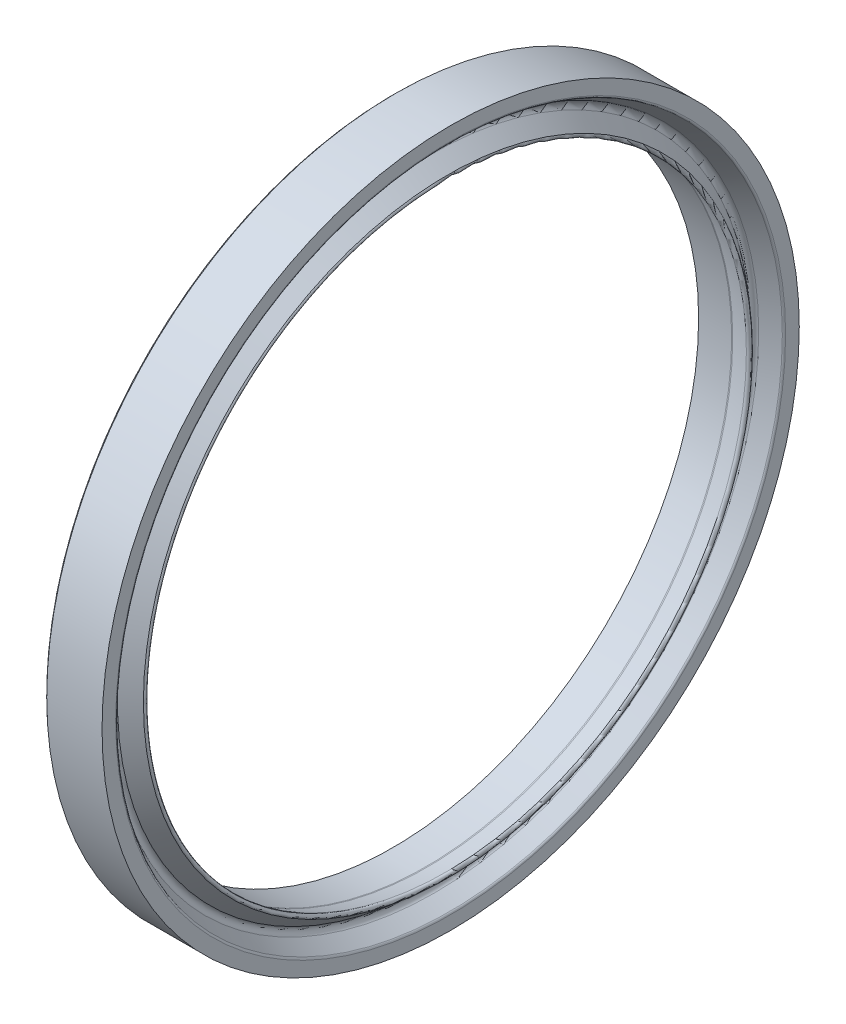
ISO-10303-21;
HEADER;
FILE_DESCRIPTION(('STEP AP214'),'2;1');
FILE_NAME('part.step','',(''),(''),'','','');
FILE_SCHEMA(('AUTOMOTIVE_DESIGN { 1 0 10303 214 1 1 1 1 }'));
ENDSEC;
DATA;
#1=APPLICATION_CONTEXT('core data for automotive mechanical design processes');
#2=APPLICATION_PROTOCOL_DEFINITION('international standard','automotive_design',2000,#1);
#3=PRODUCT_CONTEXT('',#1,'mechanical');
#4=PRODUCT('Part','Part','',(#3));
#5=PRODUCT_RELATED_PRODUCT_CATEGORY('part','',(#4));
#6=PRODUCT_DEFINITION_FORMATION('','',#4);
#7=PRODUCT_DEFINITION_CONTEXT('part definition',#1,'design');
#8=PRODUCT_DEFINITION('design','',#6,#7);
#9=PRODUCT_DEFINITION_SHAPE('','',#8);
#10=(LENGTH_UNIT() NAMED_UNIT(*) SI_UNIT(.MILLI.,.METRE.));
#11=(NAMED_UNIT(*) PLANE_ANGLE_UNIT() SI_UNIT($,.RADIAN.));
#12=(NAMED_UNIT(*) SI_UNIT($,.STERADIAN.) SOLID_ANGLE_UNIT());
#13=UNCERTAINTY_MEASURE_WITH_UNIT(LENGTH_MEASURE(1.E-05),#10,'distance_accuracy_value','');
#14=(GEOMETRIC_REPRESENTATION_CONTEXT(3) GLOBAL_UNCERTAINTY_ASSIGNED_CONTEXT((#13)) GLOBAL_UNIT_ASSIGNED_CONTEXT((#10,
#11,#12)) REPRESENTATION_CONTEXT('',''));
#15=CARTESIAN_POINT('',(0.,0.,0.));
#16=DIRECTION('',(0.,0.,1.));
#17=DIRECTION('',(1.,0.,0.));
#18=AXIS2_PLACEMENT_3D('',#15,#16,#17);
#19=CARTESIAN_POINT('',(2.43404063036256,0.,0.));
#20=DIRECTION('',(1.,0.,0.));
#21=DIRECTION('',(0.,0.,-1.));
#22=AXIS2_PLACEMENT_3D('',#19,#20,#21);
#23=CYLINDRICAL_SURFACE('',#22,29.);
#24=CARTESIAN_POINT('',(0.,0.,0.));
#25=DIRECTION('',(1.,0.,0.));
#26=DIRECTION('',(0.,0.,-1.));
#27=AXIS2_PLACEMENT_3D('',#24,#25,#26);
#28=CIRCLE('',#27,29.);
#29=CARTESIAN_POINT('',(0.,0.,-29.));
#30=VERTEX_POINT('',#29);
#31=EDGE_CURVE('E10',#30,#30,#28,.T.);
#32=ORIENTED_EDGE('',*,*,#31,.F.);
#33=EDGE_LOOP('',(#32));
#34=FACE_BOUND('',#33,.T.);
#35=CARTESIAN_POINT('',(-4.59999999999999,0.,0.));
#36=DIRECTION('',(1.,0.,0.));
#37=DIRECTION('',(0.,0.,-1.));
#38=AXIS2_PLACEMENT_3D('',#35,#36,#37);
#39=CIRCLE('',#38,29.);
#40=CARTESIAN_POINT('',(-4.59999999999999,0.,-29.));
#41=VERTEX_POINT('',#40);
#42=EDGE_CURVE('E71',#41,#41,#39,.T.);
#43=ORIENTED_EDGE('',*,*,#42,.T.);
#44=EDGE_LOOP('',(#43));
#45=FACE_BOUND('',#44,.T.);
#46=ADVANCED_FACE('F31',(#34,#45),#23,.T.);
#47=CARTESIAN_POINT('',(0.,-29.,0.));
#48=DIRECTION('',(-1.,0.,0.));
#49=DIRECTION('',(0.,0.,1.));
#50=AXIS2_PLACEMENT_3D('',#47,#48,#49);
#51=PLANE('',#50);
#52=CARTESIAN_POINT('',(0.,0.,0.));
#53=DIRECTION('',(1.,0.,0.));
#54=DIRECTION('',(0.,0.,-1.));
#55=AXIS2_PLACEMENT_3D('',#52,#53,#54);
#56=CIRCLE('',#55,27.8631927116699);
#57=CARTESIAN_POINT('',(0.,0.,-27.8631927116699));
#58=VERTEX_POINT('',#57);
#59=EDGE_CURVE('E37',#58,#58,#56,.T.);
#60=ORIENTED_EDGE('',*,*,#59,.F.);
#61=EDGE_LOOP('',(#60));
#62=FACE_BOUND('',#61,.T.);
#63=ORIENTED_EDGE('',*,*,#31,.T.);
#64=EDGE_LOOP('',(#63));
#65=FACE_BOUND('',#64,.T.);
#66=ADVANCED_FACE('F132',(#62,#65),#51,.F.);
#67=CARTESIAN_POINT('',(-0.199999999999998,0.,0.));
#68=DIRECTION('',(1.,0.,0.));
#69=DIRECTION('',(0.,0.,-1.));
#70=AXIS2_PLACEMENT_3D('',#67,#68,#69);
#71=TOROIDAL_SURFACE('',#70,27.8631927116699,0.200000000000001);
#72=CARTESIAN_POINT('',(-0.099999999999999,0.,0.));
#73=DIRECTION('',(1.,0.,0.));
#74=DIRECTION('',(0.,0.,-1.));
#75=AXIS2_PLACEMENT_3D('',#72,#73,#74);
#76=CIRCLE('',#75,27.689987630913);
#77=CARTESIAN_POINT('',(-0.099999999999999,0.,-27.689987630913));
#78=VERTEX_POINT('',#77);
#79=EDGE_CURVE('E41',#78,#78,#76,.T.);
#80=ORIENTED_EDGE('',*,*,#79,.F.);
#81=EDGE_LOOP('',(#80));
#82=FACE_BOUND('',#81,.T.);
#83=ORIENTED_EDGE('',*,*,#59,.T.);
#84=EDGE_LOOP('',(#83));
#85=FACE_BOUND('',#84,.T.);
#86=ADVANCED_FACE('F127',(#82,#85),#71,.T.);
#87=CARTESIAN_POINT('',(-0.099999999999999,0.,0.));
#88=DIRECTION('',(1.,0.,0.));
#89=DIRECTION('',(0.,0.,-1.));
#90=AXIS2_PLACEMENT_3D('',#87,#88,#89);
#91=CONICAL_SURFACE('',#90,27.689987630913,0.523598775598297);
#92=CARTESIAN_POINT('',(-1.34587850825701,0.,0.));
#93=DIRECTION('',(1.,0.,0.));
#94=DIRECTION('',(0.,0.,-1.));
#95=AXIS2_PLACEMENT_3D('',#92,#93,#94);
#96=CIRCLE('',#95,26.9706793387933);
#97=CARTESIAN_POINT('',(-1.34587850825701,0.,-26.9706793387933));
#98=VERTEX_POINT('',#97);
#99=EDGE_CURVE('E45',#98,#98,#96,.T.);
#100=ORIENTED_EDGE('',*,*,#99,.F.);
#101=EDGE_LOOP('',(#100));
#102=FACE_BOUND('',#101,.T.);
#103=ORIENTED_EDGE('',*,*,#79,.T.);
#104=EDGE_LOOP('',(#103));
#105=FACE_BOUND('',#104,.T.);
#106=ADVANCED_FACE('F121',(#102,#105),#91,.F.);
#107=CARTESIAN_POINT('',(-1.14587850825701,0.,0.));
#108=DIRECTION('',(1.,0.,0.));
#109=DIRECTION('',(0.,0.,-1.));
#110=AXIS2_PLACEMENT_3D('',#107,#108,#109);
#111=TOROIDAL_SURFACE('',#110,26.6242691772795,0.399999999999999);
#112=CARTESIAN_POINT('',(-1.40299355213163,0.,0.));
#113=DIRECTION('',(1.,0.,0.));
#114=DIRECTION('',(0.,0.,-1.));
#115=AXIS2_PLACEMENT_3D('',#112,#113,#114);
#116=CIRCLE('',#115,26.3178514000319);
#117=CARTESIAN_POINT('',(-1.40299355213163,0.,-26.3178514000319));
#118=VERTEX_POINT('',#117);
#119=EDGE_CURVE('E50',#118,#118,#116,.T.);
#120=ORIENTED_EDGE('',*,*,#119,.F.);
#121=EDGE_LOOP('',(#120));
#122=FACE_BOUND('',#121,.T.);
#123=ORIENTED_EDGE('',*,*,#99,.T.);
#124=EDGE_LOOP('',(#123));
#125=FACE_BOUND('',#124,.T.);
#126=ADVANCED_FACE('F115',(#122,#125),#111,.F.);
#127=CARTESIAN_POINT('',(-1.40299355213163,0.,0.));
#128=DIRECTION('',(-1.,0.,0.));
#129=DIRECTION('',(0.,0.,1.));
#130=AXIS2_PLACEMENT_3D('',#127,#128,#129);
#131=CONICAL_SURFACE('',#130,26.3178514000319,0.698131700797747);
#132=CARTESIAN_POINT('',(-0.227454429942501,0.,0.));
#133=DIRECTION('',(1.,0.,0.));
#134=DIRECTION('',(0.,0.,-1.));
#135=AXIS2_PLACEMENT_3D('',#132,#133,#134);
#136=CIRCLE('',#135,25.3314569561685);
#137=CARTESIAN_POINT('',(-0.227454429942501,0.,-25.3314569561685));
#138=VERTEX_POINT('',#137);
#139=EDGE_CURVE('E53',#138,#138,#136,.T.);
#140=ORIENTED_EDGE('',*,*,#139,.F.);
#141=EDGE_LOOP('',(#140));
#142=FACE_BOUND('',#141,.T.);
#143=ORIENTED_EDGE('',*,*,#119,.T.);
#144=EDGE_LOOP('',(#143));
#145=FACE_BOUND('',#144,.T.);
#146=ADVANCED_FACE('F109',(#142,#145),#131,.T.);
#147=CARTESIAN_POINT('',(-0.350468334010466,0.,0.));
#148=DIRECTION('',(1.,0.,0.));
#149=DIRECTION('',(0.,0.,-1.));
#150=AXIS2_PLACEMENT_3D('',#147,#148,#149);
#151=TOROIDAL_SURFACE('',#150,25.1848546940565,0.191375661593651);
#152=CARTESIAN_POINT('',(-0.4,0.,0.));
#153=DIRECTION('',(1.,0.,0.));
#154=DIRECTION('',(0.,0.,-1.));
#155=AXIS2_PLACEMENT_3D('',#152,#153,#154);
#156=CIRCLE('',#155,25.);
#157=CARTESIAN_POINT('',(-0.4,0.,-25.));
#158=VERTEX_POINT('',#157);
#159=EDGE_CURVE('E56',#158,#158,#156,.T.);
#160=ORIENTED_EDGE('',*,*,#159,.F.);
#161=EDGE_LOOP('',(#160));
#162=FACE_BOUND('',#161,.T.);
#163=ORIENTED_EDGE('',*,*,#139,.T.);
#164=EDGE_LOOP('',(#163));
#165=FACE_BOUND('',#164,.T.);
#166=ADVANCED_FACE('F103',(#162,#165),#151,.T.);
#167=CARTESIAN_POINT('',(-0.4,0.,0.));
#168=DIRECTION('',(-1.,0.,0.));
#169=DIRECTION('',(0.,0.,1.));
#170=AXIS2_PLACEMENT_3D('',#167,#168,#169);
#171=CONICAL_SURFACE('',#170,25.,0.261799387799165);
#172=CARTESIAN_POINT('',(-1.94913338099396,0.,0.));
#173=DIRECTION('',(1.,0.,0.));
#174=DIRECTION('',(0.,0.,-1.));
#175=AXIS2_PLACEMENT_3D('',#172,#173,#174);
#176=CIRCLE('',#175,25.4150890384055);
#177=CARTESIAN_POINT('',(-1.94913338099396,0.,-25.4150890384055));
#178=VERTEX_POINT('',#177);
#179=EDGE_CURVE('E59',#178,#178,#176,.T.);
#180=ORIENTED_EDGE('',*,*,#179,.F.);
#181=EDGE_LOOP('',(#180));
#182=FACE_BOUND('',#181,.T.);
#183=ORIENTED_EDGE('',*,*,#159,.T.);
#184=EDGE_LOOP('',(#183));
#185=FACE_BOUND('',#184,.T.);
#186=ADVANCED_FACE('F97',(#182,#185),#171,.F.);
#187=CARTESIAN_POINT('',(-2.05266099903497,0.,0.));
#188=DIRECTION('',(1.,0.,0.));
#189=DIRECTION('',(0.,0.,-1.));
#190=AXIS2_PLACEMENT_3D('',#187,#188,#189);
#191=TOROIDAL_SURFACE('',#190,25.0287187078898,0.399999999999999);
#192=CARTESIAN_POINT('',(-2.05266099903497,0.,0.));
#193=DIRECTION('',(1.,0.,0.));
#194=DIRECTION('',(0.,0.,-1.));
#195=AXIS2_PLACEMENT_3D('',#192,#193,#194);
#196=CIRCLE('',#195,25.4287187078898);
#197=CARTESIAN_POINT('',(-2.05266099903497,0.,-25.4287187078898));
#198=VERTEX_POINT('',#197);
#199=EDGE_CURVE('E62',#198,#198,#196,.T.);
#200=ORIENTED_EDGE('',*,*,#199,.F.);
#201=EDGE_LOOP('',(#200));
#202=FACE_BOUND('',#201,.T.);
#203=ORIENTED_EDGE('',*,*,#179,.T.);
#204=EDGE_LOOP('',(#203));
#205=FACE_BOUND('',#204,.T.);
#206=ADVANCED_FACE('F91',(#202,#205),#191,.F.);
#207=CARTESIAN_POINT('',(2.43404063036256,0.,0.));
#208=DIRECTION('',(1.,0.,0.));
#209=DIRECTION('',(0.,0.,-1.));
#210=AXIS2_PLACEMENT_3D('',#207,#208,#209);
#211=CYLINDRICAL_SURFACE('',#210,25.4287187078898);
#212=CARTESIAN_POINT('',(-4.8,0.,0.));
#213=DIRECTION('',(1.,0.,0.));
#214=DIRECTION('',(0.,0.,-1.));
#215=AXIS2_PLACEMENT_3D('',#212,#213,#214);
#216=CIRCLE('',#215,25.4287187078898);
#217=CARTESIAN_POINT('',(-4.8,0.,-25.4287187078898));
#218=VERTEX_POINT('',#217);
#219=EDGE_CURVE('E65',#218,#218,#216,.T.);
#220=ORIENTED_EDGE('',*,*,#219,.F.);
#221=EDGE_LOOP('',(#220));
#222=FACE_BOUND('',#221,.T.);
#223=ORIENTED_EDGE('',*,*,#199,.T.);
#224=EDGE_LOOP('',(#223));
#225=FACE_BOUND('',#224,.T.);
#226=ADVANCED_FACE('F85',(#222,#225),#211,.F.);
#227=CARTESIAN_POINT('',(-4.8,-28.8,0.));
#228=DIRECTION('',(1.,0.,0.));
#229=DIRECTION('',(0.,0.,-1.));
#230=AXIS2_PLACEMENT_3D('',#227,#228,#229);
#231=PLANE('',#230);
#232=CARTESIAN_POINT('',(-4.8,0.,0.));
#233=DIRECTION('',(1.,0.,0.));
#234=DIRECTION('',(0.,0.,-1.));
#235=AXIS2_PLACEMENT_3D('',#232,#233,#234);
#236=CIRCLE('',#235,28.8);
#237=CARTESIAN_POINT('',(-4.8,0.,-28.8));
#238=VERTEX_POINT('',#237);
#239=EDGE_CURVE('E68',#238,#238,#236,.T.);
#240=ORIENTED_EDGE('',*,*,#239,.F.);
#241=EDGE_LOOP('',(#240));
#242=FACE_BOUND('',#241,.T.);
#243=ORIENTED_EDGE('',*,*,#219,.T.);
#244=EDGE_LOOP('',(#243));
#245=FACE_BOUND('',#244,.T.);
#246=ADVANCED_FACE('F79',(#242,#245),#231,.F.);
#247=CARTESIAN_POINT('',(-4.8,0.,0.));
#248=DIRECTION('',(1.,0.,0.));
#249=DIRECTION('',(0.,0.,-1.));
#250=AXIS2_PLACEMENT_3D('',#247,#248,#249);
#251=CONICAL_SURFACE('',#250,28.8,0.785398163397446);
#252=ORIENTED_EDGE('',*,*,#42,.F.);
#253=EDGE_LOOP('',(#252));
#254=FACE_BOUND('',#253,.T.);
#255=ORIENTED_EDGE('',*,*,#239,.T.);
#256=EDGE_LOOP('',(#255));
#257=FACE_BOUND('',#256,.T.);
#258=ADVANCED_FACE('F76',(#254,#257),#251,.T.);
#259=CLOSED_SHELL('',(#46,#66,#86,#106,#126,#146,#166,#186,#206,#226,#246,#258));
#260=MANIFOLD_SOLID_BREP('B2',#259);
#261=ADVANCED_BREP_SHAPE_REPRESENTATION('',(#18,#260),#14);
#262=SHAPE_DEFINITION_REPRESENTATION(#9,#261);
ENDSEC;
END-ISO-10303-21;
